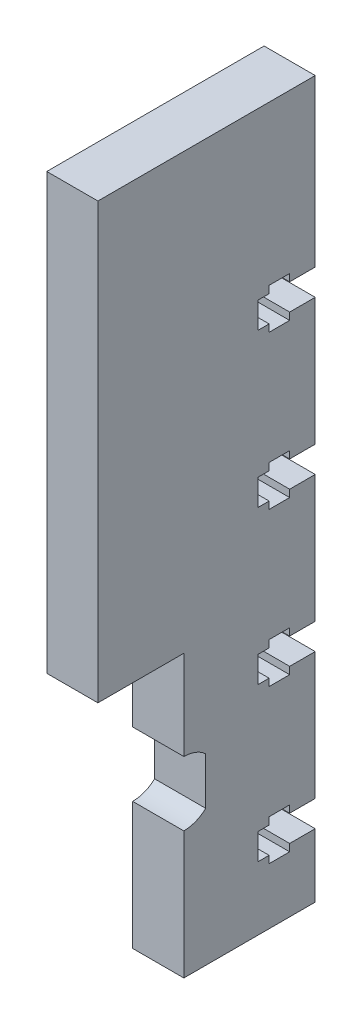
from build123d import *

# Parameters (mm, degrees)
SKETCH1_W           = 12.7
SKETCH1_H           = 177.8
BOSS_EXTRUDE1_DEPTH = 53.975
CUT_EXTRUDE1_DEPTH  = 187.245619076
CUT_EXTRUDE2_DEPTH  = 187.245619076


with BuildPart() as part:
    # Sketch1 → Boss-Extrude1 (new body)
    with BuildSketch(Plane.XY):
        with Locations((-39.36000008, 88.9)):
            Rectangle(SKETCH1_W, SKETCH1_H)
    extrude(amount=BOSS_EXTRUDE1_DEPTH)

    # Sketch4 → Cut-Extrude1 (cut, through all)
    with BuildSketch(Plane(origin=(-33.01000008, 0, 0), x_dir=(0, 0, -1), z_dir=(1, 0, 0))):
        with BuildLine():
            Line((-53.975, 69.85), (-32.635361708, 69.85))
            Line((-32.635361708, 69.85), (-32.635361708, 47.638980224))
            ThreePointArc((-32.635361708, 47.638980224), (-29.713510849, 47.086314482), (-27.195361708, 45.504677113))
            Line((-27.195361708, 45.504677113), (-27.195361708, 33.773283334))
            ThreePointArc((-27.195361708, 33.773283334), (-29.713510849, 32.191645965), (-32.635361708, 31.638980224))
            Line((-32.635361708, 31.638980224), (-32.635361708, 0))
            Line((-32.635361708, 0), (-53.975, 0))
            Line((-53.975, 0), (-53.975, 69.85))
        make_face()
    extrude(amount=-CUT_EXTRUDE1_DEPTH, mode=Mode.SUBTRACT)

    # Sketch6 → Cut-Extrude2 (cut, through all)
    with BuildSketch(Plane(origin=(-33.01000008, 0, 0), x_dir=(0, 0, -1), z_dir=(1, 0, 0))):
        Polygon((0, 92), (0, 98.5), (-6.35, 98.5), (-6.35, 100.3), (-11.45, 100.3), (-11.45, 98.5), (-14.224, 98.5), (-14.224, 92), (-11.45, 92), (-11.45, 90.2), (-6.35, 90.2), (-6.35, 92), align=None)
        Polygon((0, 130.1), (0, 136.6), (-6.35, 136.6), (-6.35, 138.4), (-11.45, 138.4), (-11.45, 136.6), (-14.224, 136.6), (-14.224, 130.1), (-11.45, 130.1), (-11.45, 128.3), (-6.35, 128.3), (-6.35, 130.1), align=None)
        Polygon((0, 53.9), (0, 60.4), (-6.35, 60.4), (-6.35, 62.2), (-11.45, 62.2), (-11.45, 60.4), (-14.224, 60.4), (-14.224, 53.9), (-11.45, 53.9), (-11.45, 52.1), (-6.35, 52.1), (-6.35, 53.9), align=None)
        Polygon((0, 15.8), (0, 22.3), (-6.35, 22.3), (-6.35, 24.1), (-11.45, 24.1), (-11.45, 22.3), (-14.224, 22.3), (-14.224, 15.8), (-11.45, 15.8), (-11.45, 14), (-6.35, 14), (-6.35, 15.8), align=None)
    extrude(amount=-CUT_EXTRUDE2_DEPTH, mode=Mode.SUBTRACT)


solid = part.part
